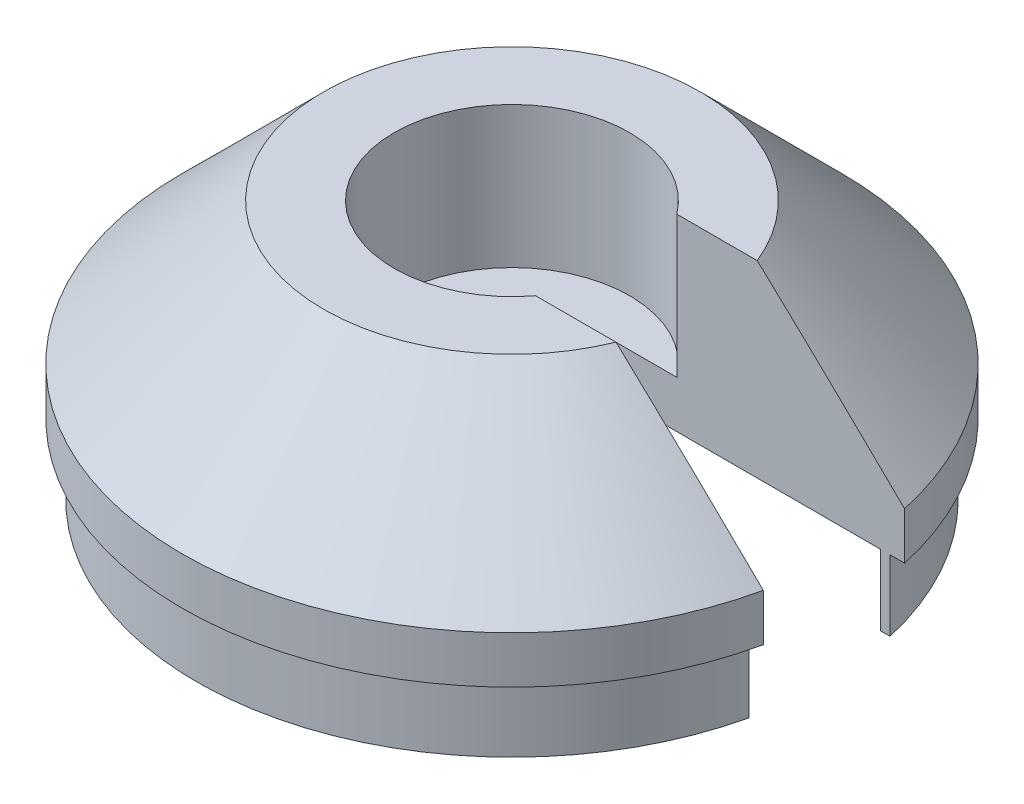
from build123d import *

# Parameters (mm, degrees)
CORTAR_EXTRUIR1_DEPTH      = 11.677078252
CORTAR_EXTRUIR1_DEPTH_BACK = 11.677078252
CROQUIS2_W                 = 7.642605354
CROQUIS2_H                 = 3


with BuildPart() as part:
    # Croquis1 → Revoluci_n1 (revolve)
    with BuildSketch(Plane.XY, mode=Mode.PRIVATE) as revoluci_n1_sk:
        Polygon((1.5, 0), (1.5, 1), (2.5, 1), (2.5, 4), (4, 4), (7, 1), (7, 0), (6.7, 0), (6.7, -1.5), (6.5, -1.5), (6.5, 0), align=None)
    revolve(revoluci_n1_sk.sketch.rotate(Axis((0, 0, 0), (0, 1, 0)), 90), axis=Axis((0, 0, 0), (0, 1, 0)))

    # Croquis2 → Cortar-Extruir1 (cut, two sides: drawn at the far end of the back side and taken through both)
    with BuildSketch(Plane(origin=(0, 0, 0), x_dir=(1, 0, 0), z_dir=(0, 1, 0)).offset(-CORTAR_EXTRUIR1_DEPTH_BACK)):
        with Locations((3.821302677, 0)):
            Rectangle(CROQUIS2_W, CROQUIS2_H)
    extrude(amount=CORTAR_EXTRUIR1_DEPTH + CORTAR_EXTRUIR1_DEPTH_BACK, mode=Mode.SUBTRACT)


solid = part.part
